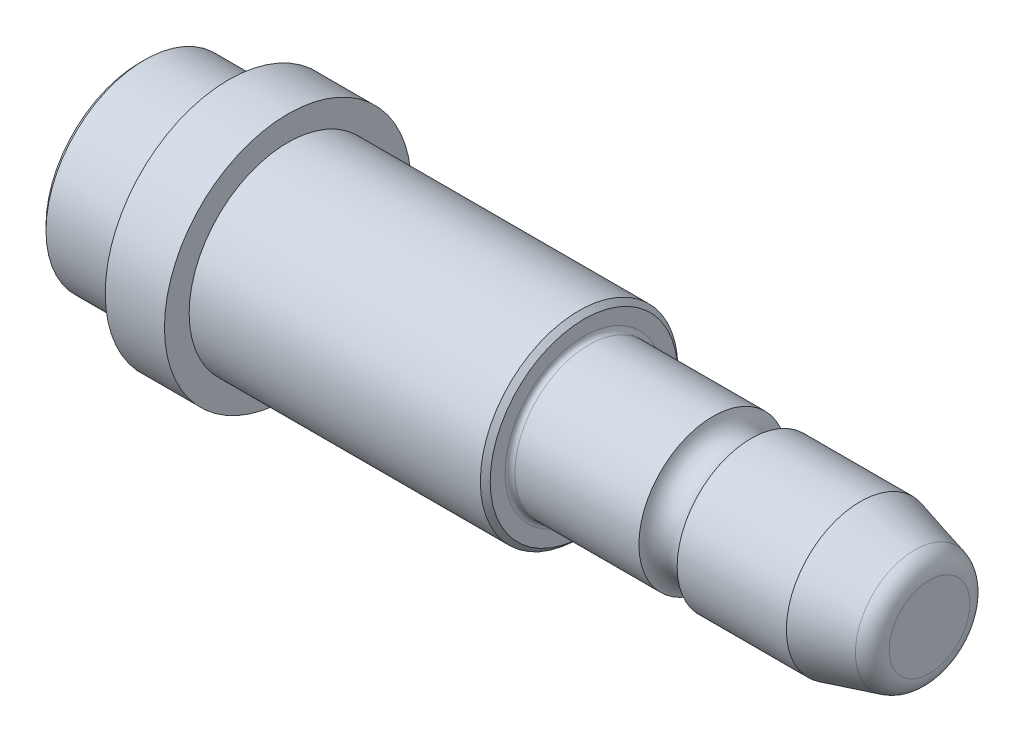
from build123d import *

# Parameters (mm, degrees)
CHANFREIN1_SIZE = 0.5
CONG_1_R        = 0.5
CONG_2_R        = 2


with BuildPart() as part:
    # Esquisse1 → Base-R_volution (revolve)
    with BuildSketch(Plane.XY, mode=Mode.PRIVATE) as base_r_volution_sk:
        with BuildLine():
            Line((9, 12.5), (15, 12.5))
            Line((15, 12.5), (15, 10))
            Line((15, 10), (45, 10))
            Line((45, 10), (45, 7.5))
            Line((45, 7.5), (58.063508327, 7.5))
            ThreePointArc((58.063508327, 7.5), (60, 6), (61.936491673, 7.5))
            Line((61.936491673, 7.5), (73, 7.5))
            Line((73, 7.5), (80, 5.624355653))
            Line((80, 5.624355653), (80, 0))
            Line((80, 0), (0, 0))
            Line((0, 0), (0, 10))
            Line((0, 10), (9, 10))
            Line((9, 10), (9, 12.5))
        make_face()
    revolve(base_r_volution_sk.sketch.rotate(Axis((-12.992566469, 0, 0), (1, 0, 0)), 90), axis=Axis((-12.992566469, 0, 0), (1, 0, 0)))

    # Chanfrein1
    chanfrein1_edges = [part.edges().sort_by_distance(p)[0] for p in [
        (0, 0, -10),
        (45, 0, -10),
    ]]
    chamfer(chanfrein1_edges, length=CHANFREIN1_SIZE)

    # Cong_1
    cong_1_edges = [part.edges().sort_by_distance(p)[0] for p in [
        (45, 0, -7.5),
    ]]
    fillet(cong_1_edges, radius=CONG_1_R)

    # Cong_2
    cong_2_edges = [part.edges().sort_by_distance(p)[0] for p in [
        (80, 0, -5.624355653),
    ]]
    fillet(cong_2_edges, radius=CONG_2_R)


solid = part.part
